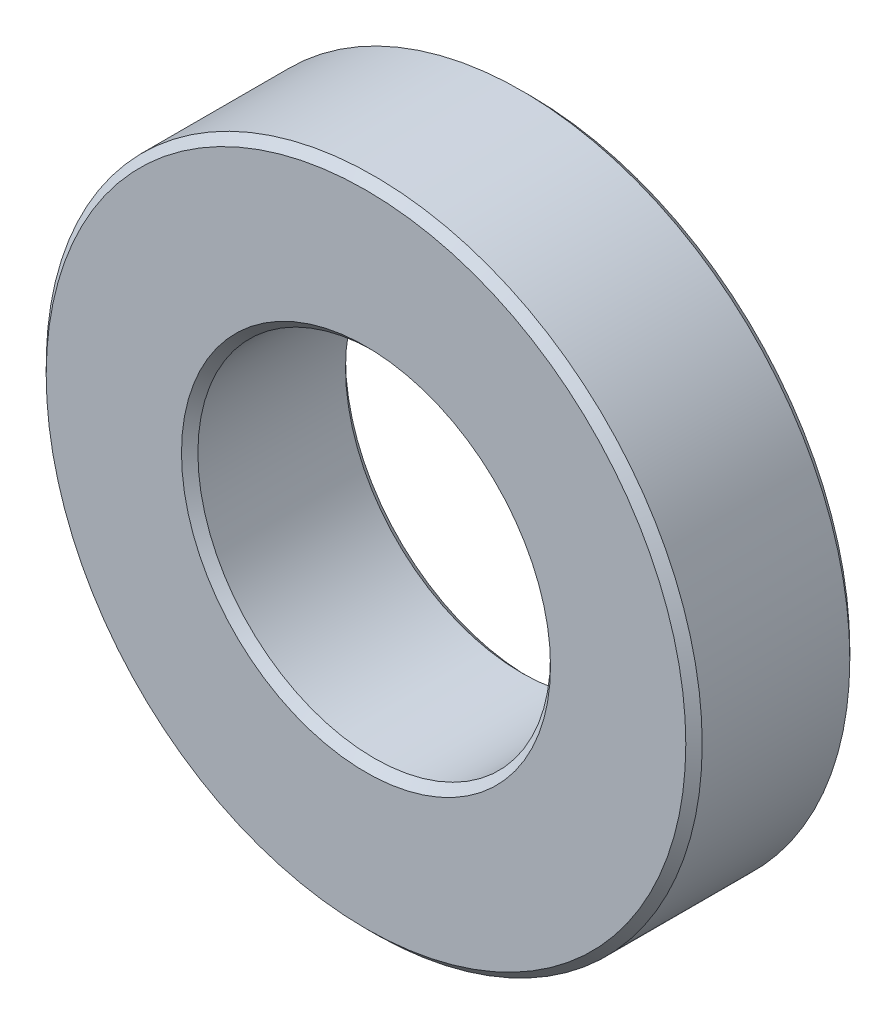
from build123d import *

# Parameters (mm, degrees)
SKETCH1_R           = 4
SKETCH1_R_2         = 2.15
BOSS_EXTRUDE2_DEPTH = 1
CHAMFER3_SIZE       = 0.1


with BuildPart() as part:
    # Sketch1 → Boss-Extrude2 (new, symmetric)
    with BuildSketch(Plane.XY):
        Circle(SKETCH1_R)
        Circle(SKETCH1_R_2, mode=Mode.SUBTRACT)
    extrude(amount=BOSS_EXTRUDE2_DEPTH, both=True)

    # Chamfer3
    chamfer3_edges = [part.edges().sort_by_distance(p)[0] for p in [
        (-4, 0, -1),
        (-4, 0, 1),
        (-2.15, 0, -1),
        (-2.15, 0, 1),
    ]]
    chamfer(chamfer3_edges, length=CHAMFER3_SIZE)


solid = part.part
